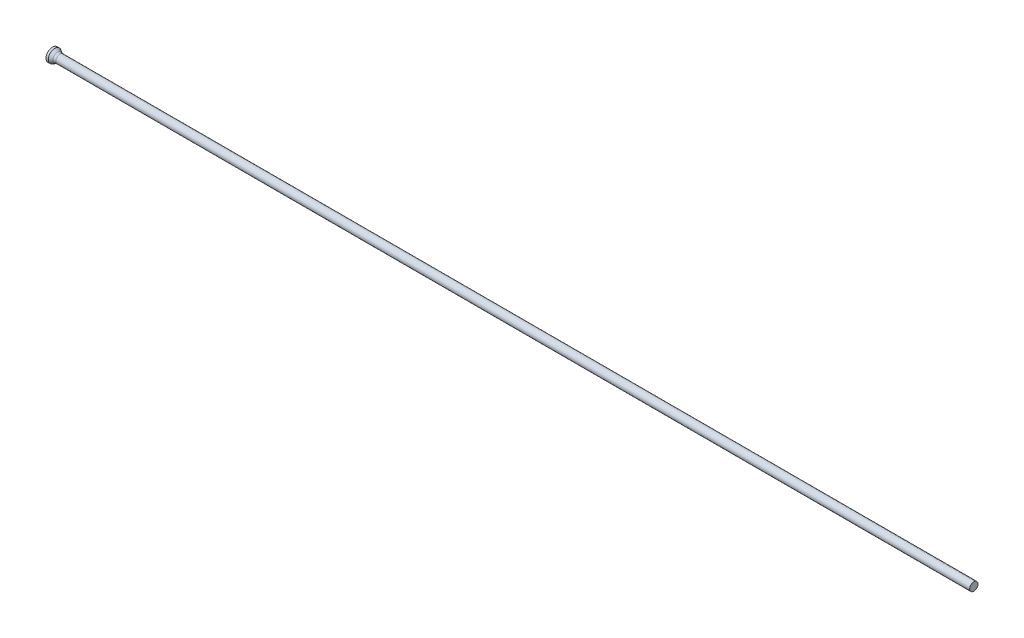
ISO-10303-21;
HEADER;
FILE_DESCRIPTION(('STEP AP214'),'2;1');
FILE_NAME('part.step','',(''),(''),'','','');
FILE_SCHEMA(('AUTOMOTIVE_DESIGN { 1 0 10303 214 1 1 1 1 }'));
ENDSEC;
DATA;
#1=APPLICATION_CONTEXT('core data for automotive mechanical design processes');
#2=APPLICATION_PROTOCOL_DEFINITION('international standard','automotive_design',2000,#1);
#3=PRODUCT_CONTEXT('',#1,'mechanical');
#4=PRODUCT('Part','Part','',(#3));
#5=PRODUCT_RELATED_PRODUCT_CATEGORY('part','',(#4));
#6=PRODUCT_DEFINITION_FORMATION('','',#4);
#7=PRODUCT_DEFINITION_CONTEXT('part definition',#1,'design');
#8=PRODUCT_DEFINITION('design','',#6,#7);
#9=PRODUCT_DEFINITION_SHAPE('','',#8);
#10=(LENGTH_UNIT() NAMED_UNIT(*) SI_UNIT(.MILLI.,.METRE.));
#11=(NAMED_UNIT(*) PLANE_ANGLE_UNIT() SI_UNIT($,.RADIAN.));
#12=(NAMED_UNIT(*) SI_UNIT($,.STERADIAN.) SOLID_ANGLE_UNIT());
#13=UNCERTAINTY_MEASURE_WITH_UNIT(LENGTH_MEASURE(1.E-05),#10,'distance_accuracy_value','');
#14=(GEOMETRIC_REPRESENTATION_CONTEXT(3) GLOBAL_UNCERTAINTY_ASSIGNED_CONTEXT((#13)) GLOBAL_UNIT_ASSIGNED_CONTEXT((#10,
#11,#12)) REPRESENTATION_CONTEXT('',''));
#15=CARTESIAN_POINT('',(0.,0.,0.));
#16=DIRECTION('',(0.,0.,1.));
#17=DIRECTION('',(1.,0.,0.));
#18=AXIS2_PLACEMENT_3D('',#15,#16,#17);
#19=CARTESIAN_POINT('',(0.,0.,0.));
#20=DIRECTION('',(1.,0.,0.));
#21=DIRECTION('',(0.,0.,-1.));
#22=AXIS2_PLACEMENT_3D('',#19,#20,#21);
#23=PLANE('',#22);
#24=CARTESIAN_POINT('',(0.,0.,0.));
#25=DIRECTION('',(-1.,0.,0.));
#26=DIRECTION('',(0.,0.,1.));
#27=AXIS2_PLACEMENT_3D('',#24,#25,#26);
#28=CIRCLE('',#27,1.4);
#29=CARTESIAN_POINT('',(0.,0.,1.4));
#30=VERTEX_POINT('',#29);
#31=EDGE_CURVE('E29',#30,#30,#28,.T.);
#32=ORIENTED_EDGE('',*,*,#31,.T.);
#33=EDGE_LOOP('',(#32));
#34=FACE_BOUND('',#33,.T.);
#35=ADVANCED_FACE('F14',(#34),#23,.F.);
#36=CARTESIAN_POINT('',(0.,0.,0.));
#37=DIRECTION('',(-1.,0.,0.));
#38=DIRECTION('',(0.,0.,1.));
#39=AXIS2_PLACEMENT_3D('',#36,#37,#38);
#40=CYLINDRICAL_SURFACE('',#39,1.4);
#41=ORIENTED_EDGE('',*,*,#31,.F.);
#42=EDGE_LOOP('',(#41));
#43=FACE_BOUND('',#42,.T.);
#44=CARTESIAN_POINT('',(0.503974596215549,0.,0.));
#45=DIRECTION('',(-1.,0.,0.));
#46=DIRECTION('',(0.,0.,1.));
#47=AXIS2_PLACEMENT_3D('',#44,#45,#46);
#48=CIRCLE('',#47,1.4);
#49=CARTESIAN_POINT('',(0.503974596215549,0.,1.4));
#50=VERTEX_POINT('',#49);
#51=EDGE_CURVE('E34',#50,#50,#48,.T.);
#52=ORIENTED_EDGE('',*,*,#51,.T.);
#53=EDGE_LOOP('',(#52));
#54=FACE_BOUND('',#53,.T.);
#55=ADVANCED_FACE('F57',(#43,#54),#40,.T.);
#56=CARTESIAN_POINT('',(1.37,0.,0.));
#57=DIRECTION('',(-1.,0.,0.));
#58=DIRECTION('',(0.,0.,1.));
#59=AXIS2_PLACEMENT_3D('',#56,#57,#58);
#60=CONICAL_SURFACE('',#59,0.9,0.523598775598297);
#61=CARTESIAN_POINT('',(1.13794919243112,0.,0.));
#62=DIRECTION('',(-1.,0.,0.));
#63=DIRECTION('',(0.,0.,1.));
#64=AXIS2_PLACEMENT_3D('',#61,#62,#63);
#65=CIRCLE('',#64,1.03397459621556);
#66=CARTESIAN_POINT('',(1.13794919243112,0.,1.03397459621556));
#67=VERTEX_POINT('',#66);
#68=EDGE_CURVE('E22',#67,#67,#65,.T.);
#69=ORIENTED_EDGE('',*,*,#68,.T.);
#70=EDGE_LOOP('',(#69));
#71=FACE_BOUND('',#70,.T.);
#72=ORIENTED_EDGE('',*,*,#51,.F.);
#73=EDGE_LOOP('',(#72));
#74=FACE_BOUND('',#73,.T.);
#75=ADVANCED_FACE('F54',(#71,#74),#60,.T.);
#76=CARTESIAN_POINT('',(0.,0.,0.));
#77=DIRECTION('',(-1.,0.,0.));
#78=DIRECTION('',(0.,0.,1.));
#79=AXIS2_PLACEMENT_3D('',#76,#77,#78);
#80=CYLINDRICAL_SURFACE('',#79,0.9);
#81=CARTESIAN_POINT('',(1.63794919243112,0.,0.));
#82=DIRECTION('',(-1.,0.,0.));
#83=DIRECTION('',(0.,0.,1.));
#84=AXIS2_PLACEMENT_3D('',#81,#82,#83);
#85=CIRCLE('',#84,0.9);
#86=CARTESIAN_POINT('',(1.63794919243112,0.,0.9));
#87=VERTEX_POINT('',#86);
#88=EDGE_CURVE('E9',#87,#87,#85,.F.);
#89=ORIENTED_EDGE('',*,*,#88,.T.);
#90=EDGE_LOOP('',(#89));
#91=FACE_BOUND('',#90,.T.);
#92=CARTESIAN_POINT('',(200.,0.,0.));
#93=DIRECTION('',(-1.,0.,0.));
#94=DIRECTION('',(0.,0.,1.));
#95=AXIS2_PLACEMENT_3D('',#92,#93,#94);
#96=CIRCLE('',#95,0.9);
#97=CARTESIAN_POINT('',(200.,0.,0.9));
#98=VERTEX_POINT('',#97);
#99=EDGE_CURVE('E39',#98,#98,#96,.T.);
#100=ORIENTED_EDGE('',*,*,#99,.T.);
#101=EDGE_LOOP('',(#100));
#102=FACE_BOUND('',#101,.T.);
#103=ADVANCED_FACE('F44',(#91,#102),#80,.T.);
#104=CARTESIAN_POINT('',(200.,0.9,0.));
#105=DIRECTION('',(-1.,0.,0.));
#106=DIRECTION('',(0.,0.,1.));
#107=AXIS2_PLACEMENT_3D('',#104,#105,#106);
#108=PLANE('',#107);
#109=ORIENTED_EDGE('',*,*,#99,.F.);
#110=EDGE_LOOP('',(#109));
#111=FACE_BOUND('',#110,.T.);
#112=ADVANCED_FACE('F46',(#111),#108,.F.);
#113=CARTESIAN_POINT('',(1.63794919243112,0.,0.));
#114=DIRECTION('',(-1.,0.,0.));
#115=DIRECTION('',(0.,0.,1.));
#116=AXIS2_PLACEMENT_3D('',#113,#114,#115);
#117=TOROIDAL_SURFACE('',#116,1.9,1.);
#118=ORIENTED_EDGE('',*,*,#88,.F.);
#119=EDGE_LOOP('',(#118));
#120=FACE_BOUND('',#119,.T.);
#121=ORIENTED_EDGE('',*,*,#68,.F.);
#122=EDGE_LOOP('',(#121));
#123=FACE_BOUND('',#122,.T.);
#124=ADVANCED_FACE('F16',(#120,#123),#117,.F.);
#125=CLOSED_SHELL('',(#35,#55,#75,#103,#112,#124));
#126=MANIFOLD_SOLID_BREP('B1',#125);
#127=ADVANCED_BREP_SHAPE_REPRESENTATION('',(#18,#126),#14);
#128=SHAPE_DEFINITION_REPRESENTATION(#9,#127);
ENDSEC;
END-ISO-10303-21;
